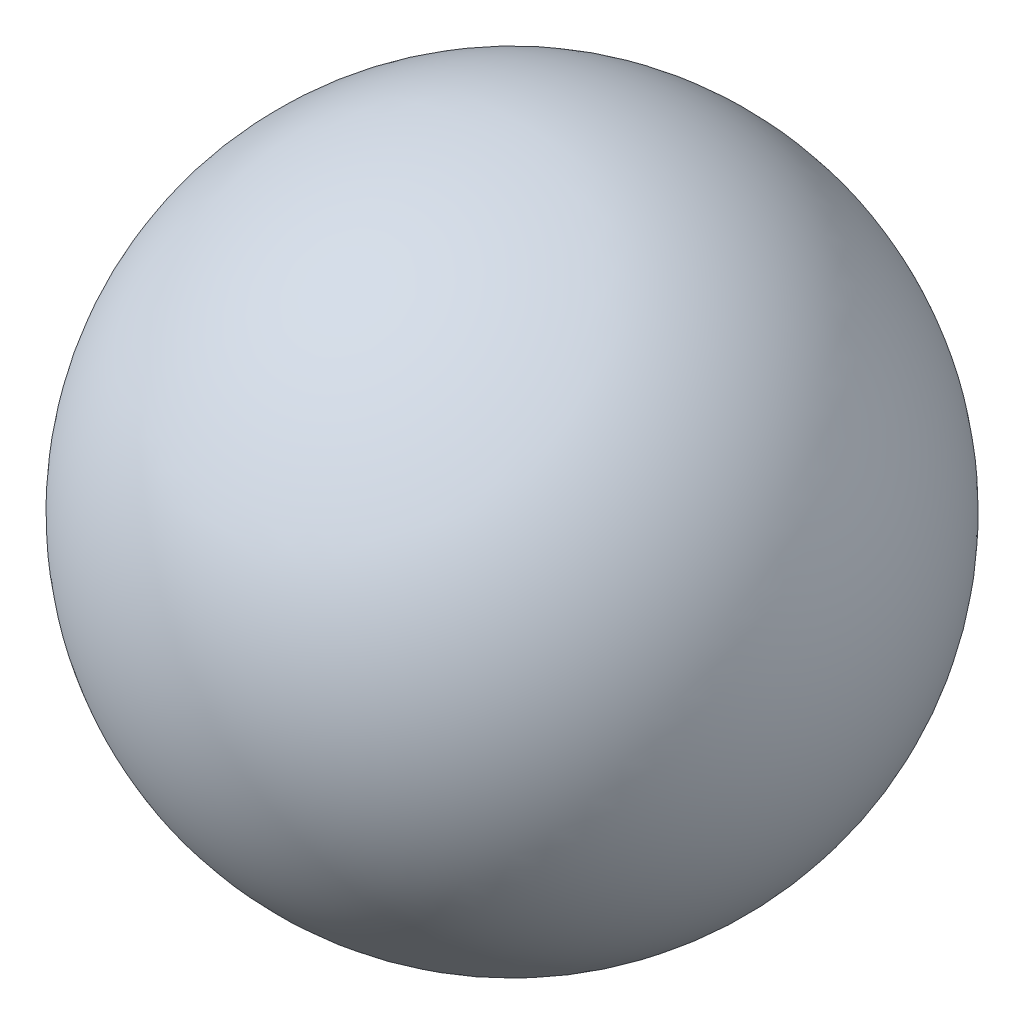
ISO-10303-21;
HEADER;
FILE_DESCRIPTION(('STEP AP214'),'2;1');
FILE_NAME('part.step','',(''),(''),'','','');
FILE_SCHEMA(('AUTOMOTIVE_DESIGN { 1 0 10303 214 1 1 1 1 }'));
ENDSEC;
DATA;
#1=APPLICATION_CONTEXT('core data for automotive mechanical design processes');
#2=APPLICATION_PROTOCOL_DEFINITION('international standard','automotive_design',2000,#1);
#3=PRODUCT_CONTEXT('',#1,'mechanical');
#4=PRODUCT('Part','Part','',(#3));
#5=PRODUCT_RELATED_PRODUCT_CATEGORY('part','',(#4));
#6=PRODUCT_DEFINITION_FORMATION('','',#4);
#7=PRODUCT_DEFINITION_CONTEXT('part definition',#1,'design');
#8=PRODUCT_DEFINITION('design','',#6,#7);
#9=PRODUCT_DEFINITION_SHAPE('','',#8);
#10=(LENGTH_UNIT() NAMED_UNIT(*) SI_UNIT(.MILLI.,.METRE.));
#11=(NAMED_UNIT(*) PLANE_ANGLE_UNIT() SI_UNIT($,.RADIAN.));
#12=(NAMED_UNIT(*) SI_UNIT($,.STERADIAN.) SOLID_ANGLE_UNIT());
#13=UNCERTAINTY_MEASURE_WITH_UNIT(LENGTH_MEASURE(1.E-05),#10,'distance_accuracy_value','');
#14=(GEOMETRIC_REPRESENTATION_CONTEXT(3) GLOBAL_UNCERTAINTY_ASSIGNED_CONTEXT((#13)) GLOBAL_UNIT_ASSIGNED_CONTEXT((#10,
#11,#12)) REPRESENTATION_CONTEXT('',''));
#15=CARTESIAN_POINT('',(0.,0.,0.));
#16=DIRECTION('',(0.,0.,1.));
#17=DIRECTION('',(1.,0.,0.));
#18=AXIS2_PLACEMENT_3D('',#15,#16,#17);
#19=CARTESIAN_POINT('',(0.,0.,0.));
#20=DIRECTION('',(0.,0.,1.));
#21=DIRECTION('',(-1.,0.,0.));
#22=AXIS2_PLACEMENT_3D('',#19,#20,#21);
#23=SPHERICAL_SURFACE('',#22,14.7404888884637);
#24=CARTESIAN_POINT('',(0.,0.,14.7404888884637));
#25=VERTEX_POINT('',#24);
#26=VERTEX_LOOP('',#25);
#27=FACE_BOUND('',#26,.T.);
#28=ADVANCED_FACE('F33',(#27),#23,.T.);
#29=CLOSED_SHELL('',(#28));
#30=MANIFOLD_SOLID_BREP('B2',#29);
#31=ADVANCED_BREP_SHAPE_REPRESENTATION('',(#18,#30),#14);
#32=SHAPE_DEFINITION_REPRESENTATION(#9,#31);
ENDSEC;
END-ISO-10303-21;
